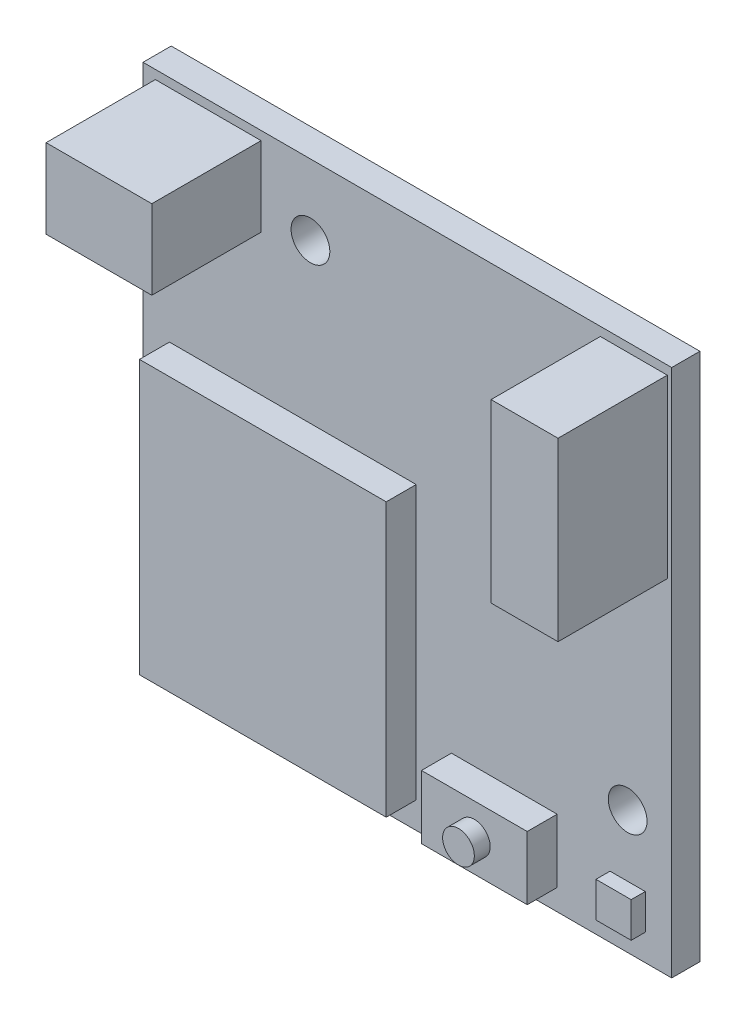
from build123d import *

# Parameters (mm, degrees)
SKIZZE1_W          = 30
SKIZZE1_H          = 30
GRUNDPLATINE_DEPTH = 1.6
SKIZZE2_R          = 1.1
BOHRUNGEN_DEPTH    = 22.273457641
SKIZZE3_W          = 6
SKIZZE3_H          = 3.6
TASTER_DEPTH       = 1.7
SKIZZE4_R          = 0.9
TASTERKNOPF_DEPTH  = 0.9
SKIZZE5_W          = 2
SKIZZE5_H          = 2
LED_DEPTH          = 0.8
SKIZZE6_W          = 14
SKIZZE6_H          = 15.5
SD_SLOT_DEPTH      = 1.7
SKIZZE7_W          = 6
SKIZZE7_H          = 4.5
SKIZZE7_W_2        = 3.8
SKIZZE7_H_2        = 10
ANSCHL_SSE_DEPTH   = 6.2


with BuildPart() as part:
    # Skizze1 → Grundplatine (new body)
    with BuildSketch(Plane.XY):
        Rectangle(SKIZZE1_W, SKIZZE1_H)
    extrude(amount=GRUNDPLATINE_DEPTH)

    # Skizze2 → Bohrungen (cut, through all)
    with BuildSketch(Plane.XY.offset(1.6)):
        with Locations((-5.5, 11)):
            Circle(SKIZZE2_R)
        with Locations((12.5, -8)):
            Circle(SKIZZE2_R)
    extrude(amount=-BOHRUNGEN_DEPTH, mode=Mode.SUBTRACT)

    # Skizze3 → Taster (add)
    with BuildSketch(Plane.XY.offset(1.6)):
        with Locations((5.5, -12)):
            Rectangle(SKIZZE3_W, SKIZZE3_H)
    extrude(amount=TASTER_DEPTH)

    # Skizze4 → Tasterknopf (add)
    with BuildSketch(Plane.XY.offset(3.3)):
        with Locations((5.5, -12)):
            Circle(SKIZZE4_R)
    extrude(amount=TASTERKNOPF_DEPTH)

    # Skizze5 → LED (add)
    with BuildSketch(Plane.XY.offset(1.6)):
        with Locations((12.5, -12.5)):
            Rectangle(SKIZZE5_W, SKIZZE5_H)
    extrude(amount=LED_DEPTH)

    # Skizze6 → SD-Slot (add)
    with BuildSketch(Plane.XY.offset(1.6)):
        with Locations((-6.5, -5.75)):
            Rectangle(SKIZZE6_W, SKIZZE6_H)
    extrude(amount=SD_SLOT_DEPTH)

    # Skizze7 → Anschl_sse (add)
    with BuildSketch(Plane.XY.offset(1.6)):
        with Locations((-11.3, 12.25)):
            Rectangle(SKIZZE7_W, SKIZZE7_H)
        with Locations((12.85, 9.5)):
            Rectangle(SKIZZE7_W_2, SKIZZE7_H_2)
    extrude(amount=ANSCHL_SSE_DEPTH)


solid = part.part
